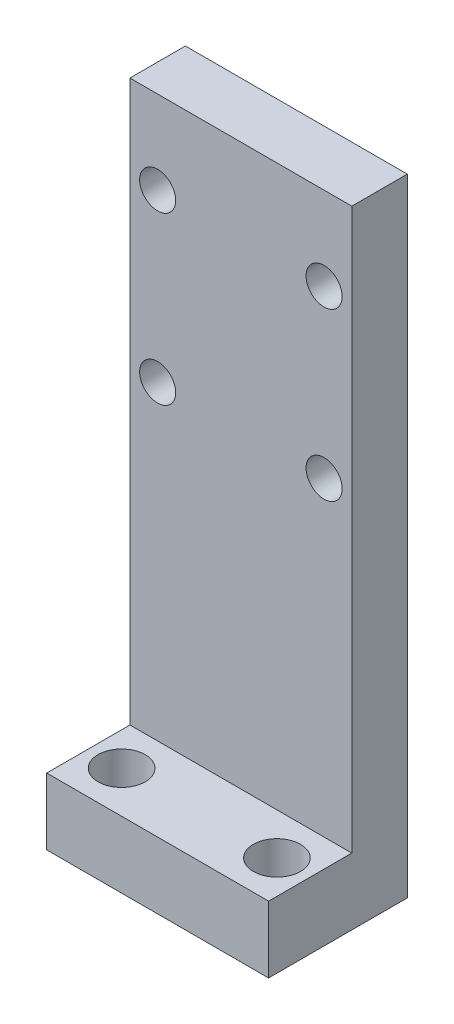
ISO-10303-21;
HEADER;
FILE_DESCRIPTION(('STEP AP214'),'2;1');
FILE_NAME('part.step','',(''),(''),'','','');
FILE_SCHEMA(('AUTOMOTIVE_DESIGN { 1 0 10303 214 1 1 1 1 }'));
ENDSEC;
DATA;
#1=APPLICATION_CONTEXT('core data for automotive mechanical design processes');
#2=APPLICATION_PROTOCOL_DEFINITION('international standard','automotive_design',2000,#1);
#3=PRODUCT_CONTEXT('',#1,'mechanical');
#4=PRODUCT('Part','Part','',(#3));
#5=PRODUCT_RELATED_PRODUCT_CATEGORY('part','',(#4));
#6=PRODUCT_DEFINITION_FORMATION('','',#4);
#7=PRODUCT_DEFINITION_CONTEXT('part definition',#1,'design');
#8=PRODUCT_DEFINITION('design','',#6,#7);
#9=PRODUCT_DEFINITION_SHAPE('','',#8);
#10=(LENGTH_UNIT() NAMED_UNIT(*) SI_UNIT(.MILLI.,.METRE.));
#11=(NAMED_UNIT(*) PLANE_ANGLE_UNIT() SI_UNIT($,.RADIAN.));
#12=(NAMED_UNIT(*) SI_UNIT($,.STERADIAN.) SOLID_ANGLE_UNIT());
#13=UNCERTAINTY_MEASURE_WITH_UNIT(LENGTH_MEASURE(1.E-05),#10,'distance_accuracy_value','');
#14=(GEOMETRIC_REPRESENTATION_CONTEXT(3) GLOBAL_UNCERTAINTY_ASSIGNED_CONTEXT((#13)) GLOBAL_UNIT_ASSIGNED_CONTEXT((#10,
#11,#12)) REPRESENTATION_CONTEXT('',''));
#15=CARTESIAN_POINT('',(0.,0.,0.));
#16=DIRECTION('',(0.,0.,1.));
#17=DIRECTION('',(1.,0.,0.));
#18=AXIS2_PLACEMENT_3D('',#15,#16,#17);
#19=CARTESIAN_POINT('',(34.,-56.5,4.99999999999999));
#20=DIRECTION('',(0.,1.,0.));
#21=DIRECTION('',(0.,0.,1.));
#22=AXIS2_PLACEMENT_3D('',#19,#20,#21);
#23=CYLINDRICAL_SURFACE('',#22,4.25000000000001);
#24=CARTESIAN_POINT('',(34.,-56.5,4.99999999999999));
#25=DIRECTION('',(0.,1.,0.));
#26=DIRECTION('',(0.,0.,1.));
#27=AXIS2_PLACEMENT_3D('',#24,#25,#26);
#28=CIRCLE('',#27,4.25000000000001);
#29=CARTESIAN_POINT('',(34.,-56.5,9.24999999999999));
#30=VERTEX_POINT('',#29);
#31=EDGE_CURVE('E121',#30,#30,#28,.F.);
#32=ORIENTED_EDGE('',*,*,#31,.T.);
#33=EDGE_LOOP('',(#32));
#34=FACE_BOUND('',#33,.T.);
#35=CARTESIAN_POINT('',(34.,-44.5,4.99999999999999));
#36=DIRECTION('',(0.,1.,0.));
#37=DIRECTION('',(0.,0.,1.));
#38=AXIS2_PLACEMENT_3D('',#35,#36,#37);
#39=CIRCLE('',#38,4.25000000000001);
#40=CARTESIAN_POINT('',(34.,-44.5,9.24999999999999));
#41=VERTEX_POINT('',#40);
#42=EDGE_CURVE('E20',#41,#41,#39,.T.);
#43=ORIENTED_EDGE('',*,*,#42,.T.);
#44=EDGE_LOOP('',(#43));
#45=FACE_BOUND('',#44,.T.);
#46=ADVANCED_FACE('F17',(#34,#45),#23,.F.);
#47=CARTESIAN_POINT('',(6.,-56.5,4.99999999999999));
#48=DIRECTION('',(0.,1.,0.));
#49=DIRECTION('',(0.,0.,1.));
#50=AXIS2_PLACEMENT_3D('',#47,#48,#49);
#51=CYLINDRICAL_SURFACE('',#50,4.25);
#52=CARTESIAN_POINT('',(6.,-56.5,4.99999999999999));
#53=DIRECTION('',(0.,1.,0.));
#54=DIRECTION('',(0.,0.,1.));
#55=AXIS2_PLACEMENT_3D('',#52,#53,#54);
#56=CIRCLE('',#55,4.25);
#57=CARTESIAN_POINT('',(6.,-56.5,9.24999999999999));
#58=VERTEX_POINT('',#57);
#59=EDGE_CURVE('E101',#58,#58,#56,.F.);
#60=ORIENTED_EDGE('',*,*,#59,.T.);
#61=EDGE_LOOP('',(#60));
#62=FACE_BOUND('',#61,.T.);
#63=CARTESIAN_POINT('',(6.,-44.5,4.99999999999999));
#64=DIRECTION('',(0.,1.,0.));
#65=DIRECTION('',(0.,0.,1.));
#66=AXIS2_PLACEMENT_3D('',#63,#64,#65);
#67=CIRCLE('',#66,4.25);
#68=CARTESIAN_POINT('',(6.,-44.5,9.24999999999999));
#69=VERTEX_POINT('',#68);
#70=EDGE_CURVE('E104',#69,#69,#67,.T.);
#71=ORIENTED_EDGE('',*,*,#70,.T.);
#72=EDGE_LOOP('',(#71));
#73=FACE_BOUND('',#72,.T.);
#74=ADVANCED_FACE('F270',(#62,#73),#51,.F.);
#75=CARTESIAN_POINT('',(40.,56.5,12.5));
#76=DIRECTION('',(0.,0.,-1.));
#77=DIRECTION('',(0.,1.,0.));
#78=AXIS2_PLACEMENT_3D('',#75,#76,#77);
#79=PLANE('',#78);
#80=DIRECTION('',(1.,0.,0.));
#81=VECTOR('',#80,1.);
#82=CARTESIAN_POINT('',(0.,-44.5,12.5));
#83=LINE('',#82,#81);
#84=CARTESIAN_POINT('',(40.,-44.5,12.5));
#85=VERTEX_POINT('',#84);
#86=CARTESIAN_POINT('',(0.,-44.5,12.5));
#87=VERTEX_POINT('',#86);
#88=EDGE_CURVE('E68',#85,#87,#83,.F.);
#89=ORIENTED_EDGE('',*,*,#88,.T.);
#90=DIRECTION('',(0.,1.,0.));
#91=VECTOR('',#90,1.);
#92=CARTESIAN_POINT('',(0.,0.,12.5));
#93=LINE('',#92,#91);
#94=CARTESIAN_POINT('',(0.,-56.5,12.5));
#95=VERTEX_POINT('',#94);
#96=EDGE_CURVE('E296',#87,#95,#93,.F.);
#97=ORIENTED_EDGE('',*,*,#96,.T.);
#98=DIRECTION('',(1.,0.,0.));
#99=VECTOR('',#98,1.);
#100=CARTESIAN_POINT('',(40.,-56.5,12.5));
#101=LINE('',#100,#99);
#102=CARTESIAN_POINT('',(40.,-56.5,12.5));
#103=VERTEX_POINT('',#102);
#104=EDGE_CURVE('E82',#95,#103,#101,.T.);
#105=ORIENTED_EDGE('',*,*,#104,.T.);
#106=DIRECTION('',(0.,1.,0.));
#107=VECTOR('',#106,1.);
#108=CARTESIAN_POINT('',(40.,0.,12.5));
#109=LINE('',#108,#107);
#110=EDGE_CURVE('E94',#85,#103,#109,.F.);
#111=ORIENTED_EDGE('',*,*,#110,.F.);
#112=EDGE_LOOP('',(#89,#97,#105,#111));
#113=FACE_BOUND('',#112,.T.);
#114=ADVANCED_FACE('F152',(#113),#79,.F.);
#115=CARTESIAN_POINT('',(0.,56.5,-2.50000000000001));
#116=DIRECTION('',(0.,0.,-1.));
#117=DIRECTION('',(0.,1.,0.));
#118=AXIS2_PLACEMENT_3D('',#115,#116,#117);
#119=PLANE('',#118);
#120=DIRECTION('',(1.,0.,0.));
#121=VECTOR('',#120,1.);
#122=CARTESIAN_POINT('',(40.,56.5,-2.50000000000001));
#123=LINE('',#122,#121);
#124=CARTESIAN_POINT('',(40.,56.5,-2.50000000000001));
#125=VERTEX_POINT('',#124);
#126=CARTESIAN_POINT('',(0.,56.5,-2.50000000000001));
#127=VERTEX_POINT('',#126);
#128=EDGE_CURVE('E307',#125,#127,#123,.F.);
#129=ORIENTED_EDGE('',*,*,#128,.T.);
#130=DIRECTION('',(0.,1.,0.));
#131=VECTOR('',#130,1.);
#132=CARTESIAN_POINT('',(0.,0.,-2.50000000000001));
#133=LINE('',#132,#131);
#134=CARTESIAN_POINT('',(0.,-44.5,-2.50000000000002));
#135=VERTEX_POINT('',#134);
#136=EDGE_CURVE('E88',#127,#135,#133,.F.);
#137=ORIENTED_EDGE('',*,*,#136,.T.);
#138=DIRECTION('',(1.,0.,0.));
#139=VECTOR('',#138,1.);
#140=CARTESIAN_POINT('',(0.,-44.5,-2.50000000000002));
#141=LINE('',#140,#139);
#142=CARTESIAN_POINT('',(40.,-44.5,-2.50000000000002));
#143=VERTEX_POINT('',#142);
#144=EDGE_CURVE('E85',#135,#143,#141,.T.);
#145=ORIENTED_EDGE('',*,*,#144,.T.);
#146=DIRECTION('',(0.,1.,0.));
#147=VECTOR('',#146,1.);
#148=CARTESIAN_POINT('',(40.,0.,-2.50000000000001));
#149=LINE('',#148,#147);
#150=EDGE_CURVE('E73',#125,#143,#149,.F.);
#151=ORIENTED_EDGE('',*,*,#150,.F.);
#152=EDGE_LOOP('',(#129,#137,#145,#151));
#153=FACE_BOUND('',#152,.T.);
#154=CARTESIAN_POINT('',(5.,41.5,-2.50000000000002));
#155=DIRECTION('',(0.,0.,1.));
#156=DIRECTION('',(1.,0.,0.));
#157=AXIS2_PLACEMENT_3D('',#154,#155,#156);
#158=CIRCLE('',#157,3.25);
#159=CARTESIAN_POINT('',(8.25,41.5,-2.50000000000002));
#160=VERTEX_POINT('',#159);
#161=EDGE_CURVE('E124',#160,#160,#158,.F.);
#162=ORIENTED_EDGE('',*,*,#161,.T.);
#163=EDGE_LOOP('',(#162));
#164=FACE_BOUND('',#163,.T.);
#165=CARTESIAN_POINT('',(35.,41.5,-2.50000000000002));
#166=DIRECTION('',(0.,0.,1.));
#167=DIRECTION('',(1.,0.,0.));
#168=AXIS2_PLACEMENT_3D('',#165,#166,#167);
#169=CIRCLE('',#168,3.25);
#170=CARTESIAN_POINT('',(38.25,41.5,-2.50000000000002));
#171=VERTEX_POINT('',#170);
#172=EDGE_CURVE('E127',#171,#171,#169,.F.);
#173=ORIENTED_EDGE('',*,*,#172,.T.);
#174=EDGE_LOOP('',(#173));
#175=FACE_BOUND('',#174,.T.);
#176=CARTESIAN_POINT('',(5.,11.5,-2.50000000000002));
#177=DIRECTION('',(0.,0.,1.));
#178=DIRECTION('',(1.,0.,0.));
#179=AXIS2_PLACEMENT_3D('',#176,#177,#178);
#180=CIRCLE('',#179,3.25);
#181=CARTESIAN_POINT('',(8.25,11.5,-2.50000000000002));
#182=VERTEX_POINT('',#181);
#183=EDGE_CURVE('E130',#182,#182,#180,.F.);
#184=ORIENTED_EDGE('',*,*,#183,.T.);
#185=EDGE_LOOP('',(#184));
#186=FACE_BOUND('',#185,.T.);
#187=CARTESIAN_POINT('',(35.,11.5,-2.50000000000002));
#188=DIRECTION('',(0.,0.,1.));
#189=DIRECTION('',(1.,0.,0.));
#190=AXIS2_PLACEMENT_3D('',#187,#188,#189);
#191=CIRCLE('',#190,3.25);
#192=CARTESIAN_POINT('',(38.25,11.5,-2.50000000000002));
#193=VERTEX_POINT('',#192);
#194=EDGE_CURVE('E90',#193,#193,#191,.F.);
#195=ORIENTED_EDGE('',*,*,#194,.T.);
#196=EDGE_LOOP('',(#195));
#197=FACE_BOUND('',#196,.T.);
#198=ADVANCED_FACE('F86',(#153,#164,#175,#186,#197),#119,.F.);
#199=CARTESIAN_POINT('',(0.,-44.5,12.5));
#200=DIRECTION('',(0.,-1.,0.));
#201=DIRECTION('',(0.,0.,-1.));
#202=AXIS2_PLACEMENT_3D('',#199,#200,#201);
#203=PLANE('',#202);
#204=ORIENTED_EDGE('',*,*,#144,.F.);
#205=DIRECTION('',(0.,0.,-1.));
#206=VECTOR('',#205,1.);
#207=CARTESIAN_POINT('',(0.,-44.5,0.));
#208=LINE('',#207,#206);
#209=EDGE_CURVE('E118',#135,#87,#208,.F.);
#210=ORIENTED_EDGE('',*,*,#209,.T.);
#211=ORIENTED_EDGE('',*,*,#88,.F.);
#212=DIRECTION('',(0.,0.,-1.));
#213=VECTOR('',#212,1.);
#214=CARTESIAN_POINT('',(40.,-44.5,0.));
#215=LINE('',#214,#213);
#216=EDGE_CURVE('E77',#143,#85,#215,.F.);
#217=ORIENTED_EDGE('',*,*,#216,.F.);
#218=EDGE_LOOP('',(#204,#210,#211,#217));
#219=FACE_BOUND('',#218,.T.);
#220=ORIENTED_EDGE('',*,*,#70,.F.);
#221=EDGE_LOOP('',(#220));
#222=FACE_BOUND('',#221,.T.);
#223=ORIENTED_EDGE('',*,*,#42,.F.);
#224=EDGE_LOOP('',(#223));
#225=FACE_BOUND('',#224,.T.);
#226=ADVANCED_FACE('F92',(#219,#222,#225),#203,.F.);
#227=CARTESIAN_POINT('',(35.,11.5,-12.5));
#228=DIRECTION('',(0.,0.,1.));
#229=DIRECTION('',(1.,0.,0.));
#230=AXIS2_PLACEMENT_3D('',#227,#228,#229);
#231=CYLINDRICAL_SURFACE('',#230,3.25);
#232=CARTESIAN_POINT('',(35.,11.5,-12.5));
#233=DIRECTION('',(0.,0.,1.));
#234=DIRECTION('',(1.,0.,0.));
#235=AXIS2_PLACEMENT_3D('',#232,#233,#234);
#236=CIRCLE('',#235,3.25);
#237=CARTESIAN_POINT('',(38.25,11.5,-12.5));
#238=VERTEX_POINT('',#237);
#239=EDGE_CURVE('E115',#238,#238,#236,.F.);
#240=ORIENTED_EDGE('',*,*,#239,.T.);
#241=EDGE_LOOP('',(#240));
#242=FACE_BOUND('',#241,.T.);
#243=ORIENTED_EDGE('',*,*,#194,.F.);
#244=EDGE_LOOP('',(#243));
#245=FACE_BOUND('',#244,.T.);
#246=ADVANCED_FACE('F142',(#242,#245),#231,.F.);
#247=CARTESIAN_POINT('',(5.,11.5,-12.5));
#248=DIRECTION('',(0.,0.,1.));
#249=DIRECTION('',(1.,0.,0.));
#250=AXIS2_PLACEMENT_3D('',#247,#248,#249);
#251=CYLINDRICAL_SURFACE('',#250,3.25);
#252=CARTESIAN_POINT('',(5.,11.5,-12.5));
#253=DIRECTION('',(0.,0.,1.));
#254=DIRECTION('',(1.,0.,0.));
#255=AXIS2_PLACEMENT_3D('',#252,#253,#254);
#256=CIRCLE('',#255,3.25);
#257=CARTESIAN_POINT('',(8.25,11.5,-12.5));
#258=VERTEX_POINT('',#257);
#259=EDGE_CURVE('E112',#258,#258,#256,.F.);
#260=ORIENTED_EDGE('',*,*,#259,.T.);
#261=EDGE_LOOP('',(#260));
#262=FACE_BOUND('',#261,.T.);
#263=ORIENTED_EDGE('',*,*,#183,.F.);
#264=EDGE_LOOP('',(#263));
#265=FACE_BOUND('',#264,.T.);
#266=ADVANCED_FACE('F149',(#262,#265),#251,.F.);
#267=CARTESIAN_POINT('',(35.,41.5,-12.5));
#268=DIRECTION('',(0.,0.,1.));
#269=DIRECTION('',(1.,0.,0.));
#270=AXIS2_PLACEMENT_3D('',#267,#268,#269);
#271=CYLINDRICAL_SURFACE('',#270,3.25);
#272=CARTESIAN_POINT('',(35.,41.5,-12.5));
#273=DIRECTION('',(0.,0.,1.));
#274=DIRECTION('',(1.,0.,0.));
#275=AXIS2_PLACEMENT_3D('',#272,#273,#274);
#276=CIRCLE('',#275,3.25);
#277=CARTESIAN_POINT('',(38.25,41.5,-12.5));
#278=VERTEX_POINT('',#277);
#279=EDGE_CURVE('E109',#278,#278,#276,.F.);
#280=ORIENTED_EDGE('',*,*,#279,.T.);
#281=EDGE_LOOP('',(#280));
#282=FACE_BOUND('',#281,.T.);
#283=ORIENTED_EDGE('',*,*,#172,.F.);
#284=EDGE_LOOP('',(#283));
#285=FACE_BOUND('',#284,.T.);
#286=ADVANCED_FACE('F179',(#282,#285),#271,.F.);
#287=CARTESIAN_POINT('',(5.,41.5,-12.5));
#288=DIRECTION('',(0.,0.,1.));
#289=DIRECTION('',(1.,0.,0.));
#290=AXIS2_PLACEMENT_3D('',#287,#288,#289);
#291=CYLINDRICAL_SURFACE('',#290,3.25);
#292=CARTESIAN_POINT('',(5.,41.5,-12.5));
#293=DIRECTION('',(0.,0.,1.));
#294=DIRECTION('',(1.,0.,0.));
#295=AXIS2_PLACEMENT_3D('',#292,#293,#294);
#296=CIRCLE('',#295,3.25);
#297=CARTESIAN_POINT('',(8.25,41.5,-12.5));
#298=VERTEX_POINT('',#297);
#299=EDGE_CURVE('E105',#298,#298,#296,.F.);
#300=ORIENTED_EDGE('',*,*,#299,.T.);
#301=EDGE_LOOP('',(#300));
#302=FACE_BOUND('',#301,.T.);
#303=ORIENTED_EDGE('',*,*,#161,.F.);
#304=EDGE_LOOP('',(#303));
#305=FACE_BOUND('',#304,.T.);
#306=ADVANCED_FACE('F175',(#302,#305),#291,.F.);
#307=CARTESIAN_POINT('',(40.,-56.5,12.5));
#308=DIRECTION('',(0.,1.,0.));
#309=DIRECTION('',(0.,0.,1.));
#310=AXIS2_PLACEMENT_3D('',#307,#308,#309);
#311=PLANE('',#310);
#312=DIRECTION('',(1.,0.,0.));
#313=VECTOR('',#312,1.);
#314=CARTESIAN_POINT('',(40.,-56.5,-12.5));
#315=LINE('',#314,#313);
#316=CARTESIAN_POINT('',(0.,-56.5,-12.5));
#317=VERTEX_POINT('',#316);
#318=CARTESIAN_POINT('',(40.,-56.5,-12.5));
#319=VERTEX_POINT('',#318);
#320=EDGE_CURVE('E108',#317,#319,#315,.T.);
#321=ORIENTED_EDGE('',*,*,#320,.T.);
#322=DIRECTION('',(0.,0.,-1.));
#323=VECTOR('',#322,1.);
#324=CARTESIAN_POINT('',(40.,-56.5,0.));
#325=LINE('',#324,#323);
#326=EDGE_CURVE('E96',#103,#319,#325,.T.);
#327=ORIENTED_EDGE('',*,*,#326,.F.);
#328=ORIENTED_EDGE('',*,*,#104,.F.);
#329=DIRECTION('',(0.,0.,-1.));
#330=VECTOR('',#329,1.);
#331=CARTESIAN_POINT('',(0.,-56.5,0.));
#332=LINE('',#331,#330);
#333=EDGE_CURVE('E303',#95,#317,#332,.T.);
#334=ORIENTED_EDGE('',*,*,#333,.T.);
#335=EDGE_LOOP('',(#321,#327,#328,#334));
#336=FACE_BOUND('',#335,.T.);
#337=ORIENTED_EDGE('',*,*,#59,.F.);
#338=EDGE_LOOP('',(#337));
#339=FACE_BOUND('',#338,.T.);
#340=ORIENTED_EDGE('',*,*,#31,.F.);
#341=EDGE_LOOP('',(#340));
#342=FACE_BOUND('',#341,.T.);
#343=ADVANCED_FACE('F172',(#336,#339,#342),#311,.F.);
#344=CARTESIAN_POINT('',(40.,0.,0.));
#345=DIRECTION('',(1.,0.,0.));
#346=DIRECTION('',(0.,0.,-1.));
#347=AXIS2_PLACEMENT_3D('',#344,#345,#346);
#348=PLANE('',#347);
#349=DIRECTION('',(0.,-1.,0.));
#350=VECTOR('',#349,1.);
#351=CARTESIAN_POINT('',(40.,56.5,-12.5));
#352=LINE('',#351,#350);
#353=CARTESIAN_POINT('',(40.,56.5,-12.5));
#354=VERTEX_POINT('',#353);
#355=EDGE_CURVE('E311',#319,#354,#352,.F.);
#356=ORIENTED_EDGE('',*,*,#355,.T.);
#357=DIRECTION('',(0.,0.,-1.));
#358=VECTOR('',#357,1.);
#359=CARTESIAN_POINT('',(40.,56.5,12.5));
#360=LINE('',#359,#358);
#361=EDGE_CURVE('E79',#354,#125,#360,.F.);
#362=ORIENTED_EDGE('',*,*,#361,.T.);
#363=ORIENTED_EDGE('',*,*,#150,.T.);
#364=ORIENTED_EDGE('',*,*,#216,.T.);
#365=ORIENTED_EDGE('',*,*,#110,.T.);
#366=ORIENTED_EDGE('',*,*,#326,.T.);
#367=EDGE_LOOP('',(#356,#362,#363,#364,#365,#366));
#368=FACE_BOUND('',#367,.T.);
#369=ADVANCED_FACE('F76',(#368),#348,.T.);
#370=CARTESIAN_POINT('',(40.,56.5,12.5));
#371=DIRECTION('',(0.,-1.,0.));
#372=DIRECTION('',(0.,0.,-1.));
#373=AXIS2_PLACEMENT_3D('',#370,#371,#372);
#374=PLANE('',#373);
#375=ORIENTED_EDGE('',*,*,#128,.F.);
#376=ORIENTED_EDGE('',*,*,#361,.F.);
#377=DIRECTION('',(1.,0.,0.));
#378=VECTOR('',#377,1.);
#379=CARTESIAN_POINT('',(40.,56.5,-12.5));
#380=LINE('',#379,#378);
#381=CARTESIAN_POINT('',(0.,56.5,-12.5));
#382=VERTEX_POINT('',#381);
#383=EDGE_CURVE('E26',#354,#382,#380,.F.);
#384=ORIENTED_EDGE('',*,*,#383,.T.);
#385=DIRECTION('',(0.,0.,-1.));
#386=VECTOR('',#385,1.);
#387=CARTESIAN_POINT('',(0.,56.5,0.));
#388=LINE('',#387,#386);
#389=EDGE_CURVE('E34',#382,#127,#388,.F.);
#390=ORIENTED_EDGE('',*,*,#389,.T.);
#391=EDGE_LOOP('',(#375,#376,#384,#390));
#392=FACE_BOUND('',#391,.T.);
#393=ADVANCED_FACE('F162',(#392),#374,.F.);
#394=CARTESIAN_POINT('',(0.,0.,0.));
#395=DIRECTION('',(1.,0.,0.));
#396=DIRECTION('',(0.,0.,-1.));
#397=AXIS2_PLACEMENT_3D('',#394,#395,#396);
#398=PLANE('',#397);
#399=ORIENTED_EDGE('',*,*,#136,.F.);
#400=ORIENTED_EDGE('',*,*,#389,.F.);
#401=DIRECTION('',(0.,-1.,0.));
#402=VECTOR('',#401,1.);
#403=CARTESIAN_POINT('',(0.,56.5,-12.5));
#404=LINE('',#403,#402);
#405=EDGE_CURVE('E11',#382,#317,#404,.T.);
#406=ORIENTED_EDGE('',*,*,#405,.T.);
#407=ORIENTED_EDGE('',*,*,#333,.F.);
#408=ORIENTED_EDGE('',*,*,#96,.F.);
#409=ORIENTED_EDGE('',*,*,#209,.F.);
#410=EDGE_LOOP('',(#399,#400,#406,#407,#408,#409));
#411=FACE_BOUND('',#410,.T.);
#412=ADVANCED_FACE('F156',(#411),#398,.F.);
#413=CARTESIAN_POINT('',(40.,56.5,-12.5));
#414=DIRECTION('',(0.,0.,1.));
#415=DIRECTION('',(0.,-1.,0.));
#416=AXIS2_PLACEMENT_3D('',#413,#414,#415);
#417=PLANE('',#416);
#418=ORIENTED_EDGE('',*,*,#383,.F.);
#419=ORIENTED_EDGE('',*,*,#355,.F.);
#420=ORIENTED_EDGE('',*,*,#320,.F.);
#421=ORIENTED_EDGE('',*,*,#405,.F.);
#422=EDGE_LOOP('',(#418,#419,#420,#421));
#423=FACE_BOUND('',#422,.T.);
#424=ORIENTED_EDGE('',*,*,#299,.F.);
#425=EDGE_LOOP('',(#424));
#426=FACE_BOUND('',#425,.T.);
#427=ORIENTED_EDGE('',*,*,#279,.F.);
#428=EDGE_LOOP('',(#427));
#429=FACE_BOUND('',#428,.T.);
#430=ORIENTED_EDGE('',*,*,#259,.F.);
#431=EDGE_LOOP('',(#430));
#432=FACE_BOUND('',#431,.T.);
#433=ORIENTED_EDGE('',*,*,#239,.F.);
#434=EDGE_LOOP('',(#433));
#435=FACE_BOUND('',#434,.T.);
#436=ADVANCED_FACE('F154',(#423,#426,#429,#432,#435),#417,.F.);
#437=CLOSED_SHELL('',(#46,#74,#114,#198,#226,#246,#266,#286,#306,#343,#369,#393,#412,#436));
#438=MANIFOLD_SOLID_BREP('B1',#437);
#439=ADVANCED_BREP_SHAPE_REPRESENTATION('',(#18,#438),#14);
#440=SHAPE_DEFINITION_REPRESENTATION(#9,#439);
ENDSEC;
END-ISO-10303-21;
